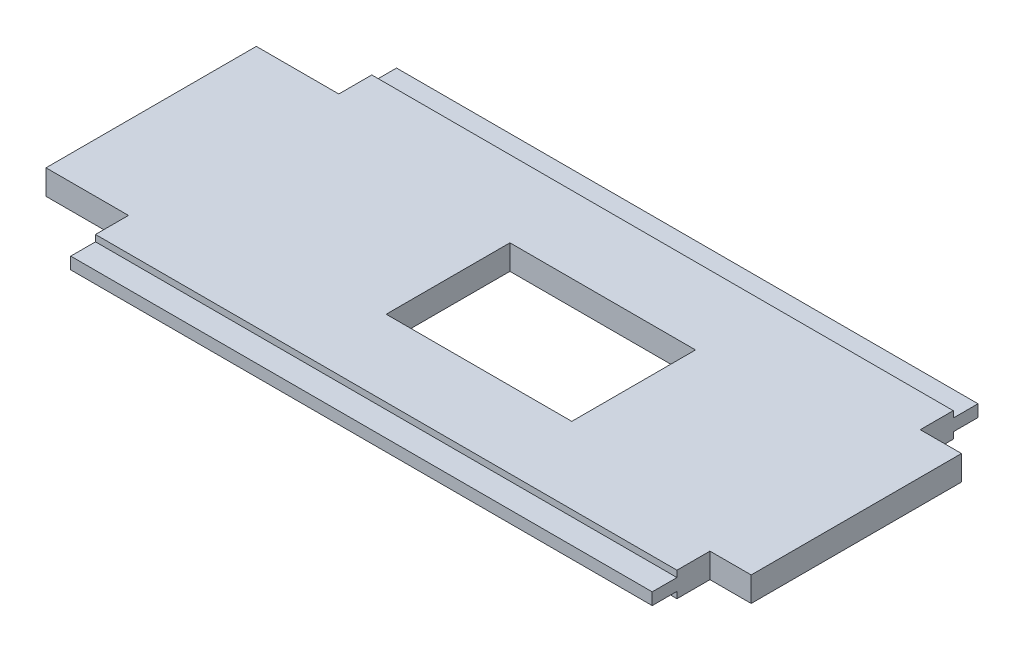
ISO-10303-21;
HEADER;
FILE_DESCRIPTION(('STEP AP214'),'2;1');
FILE_NAME('part.step','',(''),(''),'','','');
FILE_SCHEMA(('AUTOMOTIVE_DESIGN { 1 0 10303 214 1 1 1 1 }'));
ENDSEC;
DATA;
#1=APPLICATION_CONTEXT('core data for automotive mechanical design processes');
#2=APPLICATION_PROTOCOL_DEFINITION('international standard','automotive_design',2000,#1);
#3=PRODUCT_CONTEXT('',#1,'mechanical');
#4=PRODUCT('Part','Part','',(#3));
#5=PRODUCT_RELATED_PRODUCT_CATEGORY('part','',(#4));
#6=PRODUCT_DEFINITION_FORMATION('','',#4);
#7=PRODUCT_DEFINITION_CONTEXT('part definition',#1,'design');
#8=PRODUCT_DEFINITION('design','',#6,#7);
#9=PRODUCT_DEFINITION_SHAPE('','',#8);
#10=(LENGTH_UNIT() NAMED_UNIT(*) SI_UNIT(.MILLI.,.METRE.));
#11=(NAMED_UNIT(*) PLANE_ANGLE_UNIT() SI_UNIT($,.RADIAN.));
#12=(NAMED_UNIT(*) SI_UNIT($,.STERADIAN.) SOLID_ANGLE_UNIT());
#13=UNCERTAINTY_MEASURE_WITH_UNIT(LENGTH_MEASURE(1.E-05),#10,'distance_accuracy_value','');
#14=(GEOMETRIC_REPRESENTATION_CONTEXT(3) GLOBAL_UNCERTAINTY_ASSIGNED_CONTEXT((#13)) GLOBAL_UNIT_ASSIGNED_CONTEXT((#10,
#11,#12)) REPRESENTATION_CONTEXT('',''));
#15=CARTESIAN_POINT('',(0.,0.,0.));
#16=DIRECTION('',(0.,0.,1.));
#17=DIRECTION('',(1.,0.,0.));
#18=AXIS2_PLACEMENT_3D('',#15,#16,#17);
#19=CARTESIAN_POINT('',(141.,3.,0.));
#20=DIRECTION('',(-1.,0.,0.));
#21=DIRECTION('',(0.,0.,1.));
#22=AXIS2_PLACEMENT_3D('',#19,#20,#21);
#23=PLANE('',#22);
#24=DIRECTION('',(0.,-1.,0.));
#25=VECTOR('',#24,1.);
#26=CARTESIAN_POINT('',(141.,3.,-8.));
#27=LINE('',#26,#25);
#28=CARTESIAN_POINT('',(141.,3.,-8.));
#29=VERTEX_POINT('',#28);
#30=CARTESIAN_POINT('',(141.,-3.,-8.));
#31=VERTEX_POINT('',#30);
#32=EDGE_CURVE('E61',#29,#31,#27,.T.);
#33=ORIENTED_EDGE('',*,*,#32,.F.);
#34=DIRECTION('',(0.,0.,-1.));
#35=VECTOR('',#34,1.);
#36=CARTESIAN_POINT('',(141.,3.,0.));
#37=LINE('',#36,#35);
#38=CARTESIAN_POINT('',(141.,3.,0.));
#39=VERTEX_POINT('',#38);
#40=EDGE_CURVE('E402',#39,#29,#37,.T.);
#41=ORIENTED_EDGE('',*,*,#40,.F.);
#42=DIRECTION('',(0.,-1.,0.));
#43=VECTOR('',#42,1.);
#44=CARTESIAN_POINT('',(141.,3.,0.));
#45=LINE('',#44,#43);
#46=CARTESIAN_POINT('',(141.,1.45,0.));
#47=VERTEX_POINT('',#46);
#48=EDGE_CURVE('E432',#39,#47,#45,.T.);
#49=ORIENTED_EDGE('',*,*,#48,.T.);
#50=DIRECTION('',(0.,0.,-1.));
#51=VECTOR('',#50,1.);
#52=CARTESIAN_POINT('',(141.,1.45,0.));
#53=LINE('',#52,#51);
#54=CARTESIAN_POINT('',(141.,1.45,6.));
#55=VERTEX_POINT('',#54);
#56=EDGE_CURVE('E286',#55,#47,#53,.T.);
#57=ORIENTED_EDGE('',*,*,#56,.F.);
#58=DIRECTION('',(0.,-1.,0.));
#59=VECTOR('',#58,1.);
#60=CARTESIAN_POINT('',(141.,1.45,6.));
#61=LINE('',#60,#59);
#62=CARTESIAN_POINT('',(141.,-1.45,6.));
#63=VERTEX_POINT('',#62);
#64=EDGE_CURVE('E294',#55,#63,#61,.T.);
#65=ORIENTED_EDGE('',*,*,#64,.T.);
#66=DIRECTION('',(0.,0.,-1.));
#67=VECTOR('',#66,1.);
#68=CARTESIAN_POINT('',(141.,-1.45,0.));
#69=LINE('',#68,#67);
#70=CARTESIAN_POINT('',(141.,-1.45,0.));
#71=VERTEX_POINT('',#70);
#72=EDGE_CURVE('E303',#63,#71,#69,.T.);
#73=ORIENTED_EDGE('',*,*,#72,.T.);
#74=CARTESIAN_POINT('',(141.,-3.,0.));
#75=VERTEX_POINT('',#74);
#76=EDGE_CURVE('E431',#71,#75,#45,.T.);
#77=ORIENTED_EDGE('',*,*,#76,.T.);
#78=DIRECTION('',(0.,0.,-1.));
#79=VECTOR('',#78,1.);
#80=CARTESIAN_POINT('',(141.,-3.,0.));
#81=LINE('',#80,#79);
#82=EDGE_CURVE('E417',#75,#31,#81,.T.);
#83=ORIENTED_EDGE('',*,*,#82,.T.);
#84=EDGE_LOOP('',(#33,#41,#49,#57,#65,#73,#77,#83));
#85=FACE_BOUND('',#84,.T.);
#86=ADVANCED_FACE('F45',(#85),#23,.F.);
#87=DIRECTION('',(0.,1.,0.));
#88=VECTOR('',#87,1.);
#89=CARTESIAN_POINT('',(141.,3.,-59.));
#90=LINE('',#89,#88);
#91=CARTESIAN_POINT('',(141.,-3.,-59.));
#92=VERTEX_POINT('',#91);
#93=CARTESIAN_POINT('',(141.,3.,-59.));
#94=VERTEX_POINT('',#93);
#95=EDGE_CURVE('E69',#92,#94,#90,.T.);
#96=ORIENTED_EDGE('',*,*,#95,.F.);
#97=CARTESIAN_POINT('',(141.,-3.,-67.));
#98=VERTEX_POINT('',#97);
#99=EDGE_CURVE('E233',#92,#98,#81,.T.);
#100=ORIENTED_EDGE('',*,*,#99,.T.);
#101=DIRECTION('',(0.,-1.,0.));
#102=VECTOR('',#101,1.);
#103=CARTESIAN_POINT('',(141.,3.,-67.));
#104=LINE('',#103,#102);
#105=CARTESIAN_POINT('',(141.,-1.45,-67.));
#106=VERTEX_POINT('',#105);
#107=EDGE_CURVE('E428',#106,#98,#104,.T.);
#108=ORIENTED_EDGE('',*,*,#107,.F.);
#109=DIRECTION('',(0.,0.,-1.));
#110=VECTOR('',#109,1.);
#111=CARTESIAN_POINT('',(141.,-1.45,-67.));
#112=LINE('',#111,#110);
#113=CARTESIAN_POINT('',(141.,-1.45,-73.));
#114=VERTEX_POINT('',#113);
#115=EDGE_CURVE('E333',#106,#114,#112,.T.);
#116=ORIENTED_EDGE('',*,*,#115,.T.);
#117=DIRECTION('',(0.,-1.,0.));
#118=VECTOR('',#117,1.);
#119=CARTESIAN_POINT('',(141.,1.45,-73.));
#120=LINE('',#119,#118);
#121=CARTESIAN_POINT('',(141.,1.45,-73.));
#122=VERTEX_POINT('',#121);
#123=EDGE_CURVE('E269',#122,#114,#120,.T.);
#124=ORIENTED_EDGE('',*,*,#123,.F.);
#125=DIRECTION('',(0.,0.,-1.));
#126=VECTOR('',#125,1.);
#127=CARTESIAN_POINT('',(141.,1.45,-67.));
#128=LINE('',#127,#126);
#129=CARTESIAN_POINT('',(141.,1.45,-67.));
#130=VERTEX_POINT('',#129);
#131=EDGE_CURVE('E344',#130,#122,#128,.T.);
#132=ORIENTED_EDGE('',*,*,#131,.F.);
#133=CARTESIAN_POINT('',(141.,3.,-67.));
#134=VERTEX_POINT('',#133);
#135=EDGE_CURVE('E429',#134,#130,#104,.T.);
#136=ORIENTED_EDGE('',*,*,#135,.F.);
#137=EDGE_CURVE('E401',#94,#134,#37,.T.);
#138=ORIENTED_EDGE('',*,*,#137,.F.);
#139=EDGE_LOOP('',(#96,#100,#108,#116,#124,#132,#136,#138));
#140=FACE_BOUND('',#139,.T.);
#141=ADVANCED_FACE('F477',(#140),#23,.F.);
#142=CARTESIAN_POINT('',(0.,3.,0.));
#143=DIRECTION('',(1.,0.,0.));
#144=DIRECTION('',(0.,0.,-1.));
#145=AXIS2_PLACEMENT_3D('',#142,#143,#144);
#146=PLANE('',#145);
#147=DIRECTION('',(0.,0.,1.));
#148=VECTOR('',#147,1.);
#149=CARTESIAN_POINT('',(0.,-3.,0.));
#150=LINE('',#149,#148);
#151=CARTESIAN_POINT('',(0.,-3.,-67.));
#152=VERTEX_POINT('',#151);
#153=CARTESIAN_POINT('',(0.,-3.,-59.));
#154=VERTEX_POINT('',#153);
#155=EDGE_CURVE('E409',#152,#154,#150,.T.);
#156=ORIENTED_EDGE('',*,*,#155,.T.);
#157=DIRECTION('',(0.,1.,0.));
#158=VECTOR('',#157,1.);
#159=CARTESIAN_POINT('',(0.,3.,-59.));
#160=LINE('',#159,#158);
#161=CARTESIAN_POINT('',(0.,3.,-59.));
#162=VERTEX_POINT('',#161);
#163=EDGE_CURVE('E235',#154,#162,#160,.T.);
#164=ORIENTED_EDGE('',*,*,#163,.T.);
#165=DIRECTION('',(0.,0.,1.));
#166=VECTOR('',#165,1.);
#167=CARTESIAN_POINT('',(0.,3.,0.));
#168=LINE('',#167,#166);
#169=CARTESIAN_POINT('',(0.,3.,-67.));
#170=VERTEX_POINT('',#169);
#171=EDGE_CURVE('E393',#170,#162,#168,.T.);
#172=ORIENTED_EDGE('',*,*,#171,.F.);
#173=DIRECTION('',(0.,-1.,0.));
#174=VECTOR('',#173,1.);
#175=CARTESIAN_POINT('',(0.,3.,-67.));
#176=LINE('',#175,#174);
#177=CARTESIAN_POINT('',(0.,1.45,-67.));
#178=VERTEX_POINT('',#177);
#179=EDGE_CURVE('E424',#170,#178,#176,.T.);
#180=ORIENTED_EDGE('',*,*,#179,.T.);
#181=DIRECTION('',(0.,0.,1.));
#182=VECTOR('',#181,1.);
#183=CARTESIAN_POINT('',(0.,1.45,-67.));
#184=LINE('',#183,#182);
#185=CARTESIAN_POINT('',(0.,1.45,-73.));
#186=VERTEX_POINT('',#185);
#187=EDGE_CURVE('E324',#186,#178,#184,.T.);
#188=ORIENTED_EDGE('',*,*,#187,.F.);
#189=DIRECTION('',(0.,-1.,0.));
#190=VECTOR('',#189,1.);
#191=CARTESIAN_POINT('',(0.,1.45,-73.));
#192=LINE('',#191,#190);
#193=CARTESIAN_POINT('',(0.,-1.45,-73.));
#194=VERTEX_POINT('',#193);
#195=EDGE_CURVE('E320',#186,#194,#192,.T.);
#196=ORIENTED_EDGE('',*,*,#195,.T.);
#197=DIRECTION('',(0.,0.,1.));
#198=VECTOR('',#197,1.);
#199=CARTESIAN_POINT('',(0.,-1.45,-67.));
#200=LINE('',#199,#198);
#201=CARTESIAN_POINT('',(0.,-1.45,-67.));
#202=VERTEX_POINT('',#201);
#203=EDGE_CURVE('E325',#194,#202,#200,.T.);
#204=ORIENTED_EDGE('',*,*,#203,.T.);
#205=EDGE_CURVE('E408',#202,#152,#176,.T.);
#206=ORIENTED_EDGE('',*,*,#205,.T.);
#207=EDGE_LOOP('',(#156,#164,#172,#180,#188,#196,#204,#206));
#208=FACE_BOUND('',#207,.T.);
#209=ADVANCED_FACE('F483',(#208),#146,.F.);
#210=CARTESIAN_POINT('',(0.,3.,0.));
#211=DIRECTION('',(0.,0.,-1.));
#212=DIRECTION('',(-1.,0.,0.));
#213=AXIS2_PLACEMENT_3D('',#210,#211,#212);
#214=PLANE('',#213);
#215=DIRECTION('',(-1.,0.,0.));
#216=VECTOR('',#215,1.);
#217=CARTESIAN_POINT('',(0.,1.45,0.));
#218=LINE('',#217,#216);
#219=CARTESIAN_POINT('',(0.,1.45,0.));
#220=VERTEX_POINT('',#219);
#221=EDGE_CURVE('E290',#47,#220,#218,.T.);
#222=ORIENTED_EDGE('',*,*,#221,.F.);
#223=ORIENTED_EDGE('',*,*,#48,.F.);
#224=DIRECTION('',(1.,0.,0.));
#225=VECTOR('',#224,1.);
#226=CARTESIAN_POINT('',(0.,3.,0.));
#227=LINE('',#226,#225);
#228=CARTESIAN_POINT('',(0.,3.,0.));
#229=VERTEX_POINT('',#228);
#230=EDGE_CURVE('E397',#229,#39,#227,.T.);
#231=ORIENTED_EDGE('',*,*,#230,.F.);
#232=DIRECTION('',(0.,-1.,0.));
#233=VECTOR('',#232,1.);
#234=CARTESIAN_POINT('',(0.,3.,0.));
#235=LINE('',#234,#233);
#236=EDGE_CURVE('E11',#229,#220,#235,.T.);
#237=ORIENTED_EDGE('',*,*,#236,.T.);
#238=EDGE_LOOP('',(#222,#223,#231,#237));
#239=FACE_BOUND('',#238,.T.);
#240=ADVANCED_FACE('F488',(#239),#214,.F.);
#241=CARTESIAN_POINT('',(0.,3.,-67.));
#242=DIRECTION('',(0.,0.,1.));
#243=DIRECTION('',(1.,0.,0.));
#244=AXIS2_PLACEMENT_3D('',#241,#242,#243);
#245=PLANE('',#244);
#246=DIRECTION('',(1.,0.,0.));
#247=VECTOR('',#246,1.);
#248=CARTESIAN_POINT('',(0.,1.45,-67.));
#249=LINE('',#248,#247);
#250=EDGE_CURVE('E330',#178,#130,#249,.T.);
#251=ORIENTED_EDGE('',*,*,#250,.F.);
#252=ORIENTED_EDGE('',*,*,#179,.F.);
#253=DIRECTION('',(-1.,0.,0.));
#254=VECTOR('',#253,1.);
#255=CARTESIAN_POINT('',(0.,3.,-67.));
#256=LINE('',#255,#254);
#257=EDGE_CURVE('E405',#134,#170,#256,.T.);
#258=ORIENTED_EDGE('',*,*,#257,.F.);
#259=ORIENTED_EDGE('',*,*,#135,.T.);
#260=EDGE_LOOP('',(#251,#252,#258,#259));
#261=FACE_BOUND('',#260,.T.);
#262=ADVANCED_FACE('F495',(#261),#245,.F.);
#263=CARTESIAN_POINT('',(0.,3.,0.));
#264=DIRECTION('',(0.,-1.,0.));
#265=DIRECTION('',(0.,0.,-1.));
#266=AXIS2_PLACEMENT_3D('',#263,#264,#265);
#267=PLANE('',#266);
#268=ORIENTED_EDGE('',*,*,#171,.T.);
#269=DIRECTION('',(1.,0.,0.));
#270=VECTOR('',#269,1.);
#271=CARTESIAN_POINT('',(-20.,3.,-59.));
#272=LINE('',#271,#270);
#273=CARTESIAN_POINT('',(-20.,3.,-59.));
#274=VERTEX_POINT('',#273);
#275=EDGE_CURVE('E261',#274,#162,#272,.T.);
#276=ORIENTED_EDGE('',*,*,#275,.F.);
#277=DIRECTION('',(0.,0.,1.));
#278=VECTOR('',#277,1.);
#279=CARTESIAN_POINT('',(-20.,3.,-59.));
#280=LINE('',#279,#278);
#281=CARTESIAN_POINT('',(-20.,3.,-8.));
#282=VERTEX_POINT('',#281);
#283=EDGE_CURVE('E250',#274,#282,#280,.T.);
#284=ORIENTED_EDGE('',*,*,#283,.T.);
#285=DIRECTION('',(1.,0.,0.));
#286=VECTOR('',#285,1.);
#287=CARTESIAN_POINT('',(-20.,3.,-8.));
#288=LINE('',#287,#286);
#289=CARTESIAN_POINT('',(0.,3.,-8.));
#290=VERTEX_POINT('',#289);
#291=EDGE_CURVE('E273',#282,#290,#288,.T.);
#292=ORIENTED_EDGE('',*,*,#291,.T.);
#293=EDGE_CURVE('E398',#290,#229,#168,.T.);
#294=ORIENTED_EDGE('',*,*,#293,.T.);
#295=ORIENTED_EDGE('',*,*,#230,.T.);
#296=ORIENTED_EDGE('',*,*,#40,.T.);
#297=DIRECTION('',(-1.,0.,0.));
#298=VECTOR('',#297,1.);
#299=CARTESIAN_POINT('',(151.,3.,-8.));
#300=LINE('',#299,#298);
#301=CARTESIAN_POINT('',(151.,3.,-8.));
#302=VERTEX_POINT('',#301);
#303=EDGE_CURVE('E242',#302,#29,#300,.T.);
#304=ORIENTED_EDGE('',*,*,#303,.F.);
#305=DIRECTION('',(0.,0.,1.));
#306=VECTOR('',#305,1.);
#307=CARTESIAN_POINT('',(151.,3.,0.));
#308=LINE('',#307,#306);
#309=CARTESIAN_POINT('',(151.,3.,-59.));
#310=VERTEX_POINT('',#309);
#311=EDGE_CURVE('E217',#310,#302,#308,.T.);
#312=ORIENTED_EDGE('',*,*,#311,.F.);
#313=DIRECTION('',(-1.,0.,0.));
#314=VECTOR('',#313,1.);
#315=CARTESIAN_POINT('',(151.,3.,-59.));
#316=LINE('',#315,#314);
#317=EDGE_CURVE('E213',#310,#94,#316,.T.);
#318=ORIENTED_EDGE('',*,*,#317,.T.);
#319=ORIENTED_EDGE('',*,*,#137,.T.);
#320=ORIENTED_EDGE('',*,*,#257,.T.);
#321=EDGE_LOOP('',(#268,#276,#284,#292,#294,#295,#296,#304,#312,#318,#319,#320));
#322=FACE_BOUND('',#321,.T.);
#323=DIRECTION('',(0.,0.,1.));
#324=VECTOR('',#323,1.);
#325=CARTESIAN_POINT('',(52.,3.,-48.5));
#326=LINE('',#325,#324);
#327=CARTESIAN_POINT('',(52.,3.,-48.5));
#328=VERTEX_POINT('',#327);
#329=CARTESIAN_POINT('',(52.,3.,-18.5));
#330=VERTEX_POINT('',#329);
#331=EDGE_CURVE('E350',#328,#330,#326,.T.);
#332=ORIENTED_EDGE('',*,*,#331,.F.);
#333=DIRECTION('',(-1.,0.,0.));
#334=VECTOR('',#333,1.);
#335=CARTESIAN_POINT('',(52.,3.,-48.5));
#336=LINE('',#335,#334);
#337=CARTESIAN_POINT('',(97.,3.,-48.5));
#338=VERTEX_POINT('',#337);
#339=EDGE_CURVE('E361',#338,#328,#336,.T.);
#340=ORIENTED_EDGE('',*,*,#339,.F.);
#341=DIRECTION('',(0.,0.,-1.));
#342=VECTOR('',#341,1.);
#343=CARTESIAN_POINT('',(97.,3.,-48.5));
#344=LINE('',#343,#342);
#345=CARTESIAN_POINT('',(97.,3.,-18.5));
#346=VERTEX_POINT('',#345);
#347=EDGE_CURVE('E357',#346,#338,#344,.T.);
#348=ORIENTED_EDGE('',*,*,#347,.F.);
#349=DIRECTION('',(1.,0.,0.));
#350=VECTOR('',#349,1.);
#351=CARTESIAN_POINT('',(52.,3.,-18.5));
#352=LINE('',#351,#350);
#353=EDGE_CURVE('E353',#330,#346,#352,.T.);
#354=ORIENTED_EDGE('',*,*,#353,.F.);
#355=EDGE_LOOP('',(#332,#340,#348,#354));
#356=FACE_BOUND('',#355,.T.);
#357=ADVANCED_FACE('F464',(#322,#356),#267,.F.);
#358=CARTESIAN_POINT('',(0.,-3.,0.));
#359=DIRECTION('',(0.,-1.,0.));
#360=DIRECTION('',(0.,0.,-1.));
#361=AXIS2_PLACEMENT_3D('',#358,#359,#360);
#362=PLANE('',#361);
#363=ORIENTED_EDGE('',*,*,#155,.F.);
#364=DIRECTION('',(-1.,0.,0.));
#365=VECTOR('',#364,1.);
#366=CARTESIAN_POINT('',(0.,-3.,-67.));
#367=LINE('',#366,#365);
#368=EDGE_CURVE('E420',#98,#152,#367,.T.);
#369=ORIENTED_EDGE('',*,*,#368,.F.);
#370=ORIENTED_EDGE('',*,*,#99,.F.);
#371=DIRECTION('',(-1.,0.,0.));
#372=VECTOR('',#371,1.);
#373=CARTESIAN_POINT('',(151.,-3.,-59.));
#374=LINE('',#373,#372);
#375=CARTESIAN_POINT('',(151.,-3.,-59.));
#376=VERTEX_POINT('',#375);
#377=EDGE_CURVE('E211',#376,#92,#374,.T.);
#378=ORIENTED_EDGE('',*,*,#377,.F.);
#379=DIRECTION('',(0.,0.,-1.));
#380=VECTOR('',#379,1.);
#381=CARTESIAN_POINT('',(151.,-3.,0.));
#382=LINE('',#381,#380);
#383=CARTESIAN_POINT('',(151.,-3.,-8.));
#384=VERTEX_POINT('',#383);
#385=EDGE_CURVE('E218',#384,#376,#382,.T.);
#386=ORIENTED_EDGE('',*,*,#385,.F.);
#387=DIRECTION('',(-1.,0.,0.));
#388=VECTOR('',#387,1.);
#389=CARTESIAN_POINT('',(151.,-3.,-8.));
#390=LINE('',#389,#388);
#391=EDGE_CURVE('E448',#384,#31,#390,.T.);
#392=ORIENTED_EDGE('',*,*,#391,.T.);
#393=ORIENTED_EDGE('',*,*,#82,.F.);
#394=DIRECTION('',(1.,0.,0.));
#395=VECTOR('',#394,1.);
#396=CARTESIAN_POINT('',(0.,-3.,0.));
#397=LINE('',#396,#395);
#398=CARTESIAN_POINT('',(0.,-3.,0.));
#399=VERTEX_POINT('',#398);
#400=EDGE_CURVE('E413',#399,#75,#397,.T.);
#401=ORIENTED_EDGE('',*,*,#400,.F.);
#402=CARTESIAN_POINT('',(0.,-3.,-8.));
#403=VERTEX_POINT('',#402);
#404=EDGE_CURVE('E392',#403,#399,#150,.T.);
#405=ORIENTED_EDGE('',*,*,#404,.F.);
#406=DIRECTION('',(1.,0.,0.));
#407=VECTOR('',#406,1.);
#408=CARTESIAN_POINT('',(-20.,-3.,-8.));
#409=LINE('',#408,#407);
#410=CARTESIAN_POINT('',(-20.,-3.,-8.));
#411=VERTEX_POINT('',#410);
#412=EDGE_CURVE('E270',#411,#403,#409,.T.);
#413=ORIENTED_EDGE('',*,*,#412,.F.);
#414=DIRECTION('',(0.,0.,-1.));
#415=VECTOR('',#414,1.);
#416=CARTESIAN_POINT('',(-20.,-3.,-59.));
#417=LINE('',#416,#415);
#418=CARTESIAN_POINT('',(-20.,-3.,-59.));
#419=VERTEX_POINT('',#418);
#420=EDGE_CURVE('E258',#411,#419,#417,.T.);
#421=ORIENTED_EDGE('',*,*,#420,.T.);
#422=DIRECTION('',(1.,0.,0.));
#423=VECTOR('',#422,1.);
#424=CARTESIAN_POINT('',(-20.,-3.,-59.));
#425=LINE('',#424,#423);
#426=EDGE_CURVE('E266',#419,#154,#425,.T.);
#427=ORIENTED_EDGE('',*,*,#426,.T.);
#428=EDGE_LOOP('',(#363,#369,#370,#378,#386,#392,#393,#401,#405,#413,#421,#427));
#429=FACE_BOUND('',#428,.T.);
#430=DIRECTION('',(-1.,0.,0.));
#431=VECTOR('',#430,1.);
#432=CARTESIAN_POINT('',(52.,-3.,-48.5));
#433=LINE('',#432,#431);
#434=CARTESIAN_POINT('',(97.,-3.,-48.5));
#435=VERTEX_POINT('',#434);
#436=CARTESIAN_POINT('',(52.,-3.,-48.5));
#437=VERTEX_POINT('',#436);
#438=EDGE_CURVE('E354',#435,#437,#433,.T.);
#439=ORIENTED_EDGE('',*,*,#438,.T.);
#440=DIRECTION('',(0.,0.,1.));
#441=VECTOR('',#440,1.);
#442=CARTESIAN_POINT('',(52.,-3.,-48.5));
#443=LINE('',#442,#441);
#444=CARTESIAN_POINT('',(52.,-3.,-18.5));
#445=VERTEX_POINT('',#444);
#446=EDGE_CURVE('E316',#437,#445,#443,.T.);
#447=ORIENTED_EDGE('',*,*,#446,.T.);
#448=DIRECTION('',(1.,0.,0.));
#449=VECTOR('',#448,1.);
#450=CARTESIAN_POINT('',(52.,-3.,-18.5));
#451=LINE('',#450,#449);
#452=CARTESIAN_POINT('',(97.,-3.,-18.5));
#453=VERTEX_POINT('',#452);
#454=EDGE_CURVE('E368',#445,#453,#451,.T.);
#455=ORIENTED_EDGE('',*,*,#454,.T.);
#456=DIRECTION('',(0.,0.,-1.));
#457=VECTOR('',#456,1.);
#458=CARTESIAN_POINT('',(97.,-3.,-48.5));
#459=LINE('',#458,#457);
#460=EDGE_CURVE('E372',#453,#435,#459,.T.);
#461=ORIENTED_EDGE('',*,*,#460,.T.);
#462=EDGE_LOOP('',(#439,#447,#455,#461));
#463=FACE_BOUND('',#462,.T.);
#464=ADVANCED_FACE('F230',(#429,#463),#362,.T.);
#465=ORIENTED_EDGE('',*,*,#293,.F.);
#466=DIRECTION('',(0.,-1.,0.));
#467=VECTOR('',#466,1.);
#468=CARTESIAN_POINT('',(0.,3.,-8.));
#469=LINE('',#468,#467);
#470=EDGE_CURVE('E240',#290,#403,#469,.T.);
#471=ORIENTED_EDGE('',*,*,#470,.T.);
#472=ORIENTED_EDGE('',*,*,#404,.T.);
#473=CARTESIAN_POINT('',(0.,-1.45,0.));
#474=VERTEX_POINT('',#473);
#475=EDGE_CURVE('E54',#474,#399,#235,.T.);
#476=ORIENTED_EDGE('',*,*,#475,.F.);
#477=DIRECTION('',(0.,0.,1.));
#478=VECTOR('',#477,1.);
#479=CARTESIAN_POINT('',(0.,-1.45,0.));
#480=LINE('',#479,#478);
#481=CARTESIAN_POINT('',(0.,-1.45,6.));
#482=VERTEX_POINT('',#481);
#483=EDGE_CURVE('E295',#474,#482,#480,.T.);
#484=ORIENTED_EDGE('',*,*,#483,.T.);
#485=DIRECTION('',(0.,-1.,0.));
#486=VECTOR('',#485,1.);
#487=CARTESIAN_POINT('',(0.,1.45,6.));
#488=LINE('',#487,#486);
#489=CARTESIAN_POINT('',(0.,1.45,6.));
#490=VERTEX_POINT('',#489);
#491=EDGE_CURVE('E312',#490,#482,#488,.T.);
#492=ORIENTED_EDGE('',*,*,#491,.F.);
#493=DIRECTION('',(0.,0.,1.));
#494=VECTOR('',#493,1.);
#495=CARTESIAN_POINT('',(0.,1.45,0.));
#496=LINE('',#495,#494);
#497=EDGE_CURVE('E278',#220,#490,#496,.T.);
#498=ORIENTED_EDGE('',*,*,#497,.F.);
#499=ORIENTED_EDGE('',*,*,#236,.F.);
#500=EDGE_LOOP('',(#465,#471,#472,#476,#484,#492,#498,#499));
#501=FACE_BOUND('',#500,.T.);
#502=ADVANCED_FACE('F47',(#501),#146,.F.);
#503=ORIENTED_EDGE('',*,*,#76,.F.);
#504=DIRECTION('',(-1.,0.,0.));
#505=VECTOR('',#504,1.);
#506=CARTESIAN_POINT('',(0.,-1.45,0.));
#507=LINE('',#506,#505);
#508=EDGE_CURVE('E283',#71,#474,#507,.T.);
#509=ORIENTED_EDGE('',*,*,#508,.T.);
#510=ORIENTED_EDGE('',*,*,#475,.T.);
#511=ORIENTED_EDGE('',*,*,#400,.T.);
#512=EDGE_LOOP('',(#503,#509,#510,#511));
#513=FACE_BOUND('',#512,.T.);
#514=ADVANCED_FACE('F445',(#513),#214,.F.);
#515=ORIENTED_EDGE('',*,*,#205,.F.);
#516=DIRECTION('',(1.,0.,0.));
#517=VECTOR('',#516,1.);
#518=CARTESIAN_POINT('',(0.,-1.45,-67.));
#519=LINE('',#518,#517);
#520=EDGE_CURVE('E300',#202,#106,#519,.T.);
#521=ORIENTED_EDGE('',*,*,#520,.T.);
#522=ORIENTED_EDGE('',*,*,#107,.T.);
#523=ORIENTED_EDGE('',*,*,#368,.T.);
#524=EDGE_LOOP('',(#515,#521,#522,#523));
#525=FACE_BOUND('',#524,.T.);
#526=ADVANCED_FACE('F485',(#525),#245,.F.);
#527=CARTESIAN_POINT('',(52.,3.,-48.5));
#528=DIRECTION('',(1.,0.,0.));
#529=DIRECTION('',(0.,0.,-1.));
#530=AXIS2_PLACEMENT_3D('',#527,#528,#529);
#531=PLANE('',#530);
#532=ORIENTED_EDGE('',*,*,#446,.F.);
#533=DIRECTION('',(0.,-1.,0.));
#534=VECTOR('',#533,1.);
#535=CARTESIAN_POINT('',(52.,3.,-48.5));
#536=LINE('',#535,#534);
#537=EDGE_CURVE('E364',#328,#437,#536,.T.);
#538=ORIENTED_EDGE('',*,*,#537,.F.);
#539=ORIENTED_EDGE('',*,*,#331,.T.);
#540=DIRECTION('',(0.,-1.,0.));
#541=VECTOR('',#540,1.);
#542=CARTESIAN_POINT('',(52.,3.,-18.5));
#543=LINE('',#542,#541);
#544=EDGE_CURVE('E388',#330,#445,#543,.T.);
#545=ORIENTED_EDGE('',*,*,#544,.T.);
#546=EDGE_LOOP('',(#532,#538,#539,#545));
#547=FACE_BOUND('',#546,.T.);
#548=ADVANCED_FACE('F493',(#547),#531,.T.);
#549=CARTESIAN_POINT('',(52.,3.,-18.5));
#550=DIRECTION('',(0.,0.,-1.));
#551=DIRECTION('',(-1.,0.,0.));
#552=AXIS2_PLACEMENT_3D('',#549,#550,#551);
#553=PLANE('',#552);
#554=ORIENTED_EDGE('',*,*,#454,.F.);
#555=ORIENTED_EDGE('',*,*,#544,.F.);
#556=ORIENTED_EDGE('',*,*,#353,.T.);
#557=DIRECTION('',(0.,-1.,0.));
#558=VECTOR('',#557,1.);
#559=CARTESIAN_POINT('',(97.,3.,-18.5));
#560=LINE('',#559,#558);
#561=EDGE_CURVE('E385',#346,#453,#560,.T.);
#562=ORIENTED_EDGE('',*,*,#561,.T.);
#563=EDGE_LOOP('',(#554,#555,#556,#562));
#564=FACE_BOUND('',#563,.T.);
#565=ADVANCED_FACE('F583',(#564),#553,.T.);
#566=CARTESIAN_POINT('',(97.,3.,-48.5));
#567=DIRECTION('',(-1.,0.,0.));
#568=DIRECTION('',(0.,0.,1.));
#569=AXIS2_PLACEMENT_3D('',#566,#567,#568);
#570=PLANE('',#569);
#571=ORIENTED_EDGE('',*,*,#460,.F.);
#572=ORIENTED_EDGE('',*,*,#561,.F.);
#573=ORIENTED_EDGE('',*,*,#347,.T.);
#574=DIRECTION('',(0.,-1.,0.));
#575=VECTOR('',#574,1.);
#576=CARTESIAN_POINT('',(97.,3.,-48.5));
#577=LINE('',#576,#575);
#578=EDGE_CURVE('E382',#338,#435,#577,.T.);
#579=ORIENTED_EDGE('',*,*,#578,.T.);
#580=EDGE_LOOP('',(#571,#572,#573,#579));
#581=FACE_BOUND('',#580,.T.);
#582=ADVANCED_FACE('F579',(#581),#570,.T.);
#583=CARTESIAN_POINT('',(52.,3.,-48.5));
#584=DIRECTION('',(0.,0.,1.));
#585=DIRECTION('',(1.,0.,0.));
#586=AXIS2_PLACEMENT_3D('',#583,#584,#585);
#587=PLANE('',#586);
#588=ORIENTED_EDGE('',*,*,#438,.F.);
#589=ORIENTED_EDGE('',*,*,#578,.F.);
#590=ORIENTED_EDGE('',*,*,#339,.T.);
#591=ORIENTED_EDGE('',*,*,#537,.T.);
#592=EDGE_LOOP('',(#588,#589,#590,#591));
#593=FACE_BOUND('',#592,.T.);
#594=ADVANCED_FACE('F573',(#593),#587,.T.);
#595=CARTESIAN_POINT('',(0.,1.45,-73.));
#596=DIRECTION('',(0.,0.,1.));
#597=DIRECTION('',(1.,0.,0.));
#598=AXIS2_PLACEMENT_3D('',#595,#596,#597);
#599=PLANE('',#598);
#600=DIRECTION('',(-1.,0.,0.));
#601=VECTOR('',#600,1.);
#602=CARTESIAN_POINT('',(0.,-1.45,-73.));
#603=LINE('',#602,#601);
#604=EDGE_CURVE('E329',#114,#194,#603,.T.);
#605=ORIENTED_EDGE('',*,*,#604,.T.);
#606=ORIENTED_EDGE('',*,*,#195,.F.);
#607=DIRECTION('',(-1.,0.,0.));
#608=VECTOR('',#607,1.);
#609=CARTESIAN_POINT('',(0.,1.45,-73.));
#610=LINE('',#609,#608);
#611=EDGE_CURVE('E341',#122,#186,#610,.T.);
#612=ORIENTED_EDGE('',*,*,#611,.F.);
#613=ORIENTED_EDGE('',*,*,#123,.T.);
#614=EDGE_LOOP('',(#605,#606,#612,#613));
#615=FACE_BOUND('',#614,.T.);
#616=ADVANCED_FACE('F542',(#615),#599,.F.);
#617=CARTESIAN_POINT('',(0.,1.45,0.));
#618=DIRECTION('',(0.,1.,0.));
#619=DIRECTION('',(0.,0.,1.));
#620=AXIS2_PLACEMENT_3D('',#617,#618,#619);
#621=PLANE('',#620);
#622=ORIENTED_EDGE('',*,*,#250,.T.);
#623=ORIENTED_EDGE('',*,*,#131,.T.);
#624=ORIENTED_EDGE('',*,*,#611,.T.);
#625=ORIENTED_EDGE('',*,*,#187,.T.);
#626=EDGE_LOOP('',(#622,#623,#624,#625));
#627=FACE_BOUND('',#626,.T.);
#628=ADVANCED_FACE('F544',(#627),#621,.T.);
#629=CARTESIAN_POINT('',(0.,-1.45,0.));
#630=DIRECTION('',(0.,1.,0.));
#631=DIRECTION('',(0.,0.,1.));
#632=AXIS2_PLACEMENT_3D('',#629,#630,#631);
#633=PLANE('',#632);
#634=ORIENTED_EDGE('',*,*,#520,.F.);
#635=ORIENTED_EDGE('',*,*,#203,.F.);
#636=ORIENTED_EDGE('',*,*,#604,.F.);
#637=ORIENTED_EDGE('',*,*,#115,.F.);
#638=EDGE_LOOP('',(#634,#635,#636,#637));
#639=FACE_BOUND('',#638,.T.);
#640=ADVANCED_FACE('F537',(#639),#633,.F.);
#641=CARTESIAN_POINT('',(0.,1.45,6.));
#642=DIRECTION('',(0.,0.,-1.));
#643=DIRECTION('',(-1.,0.,0.));
#644=AXIS2_PLACEMENT_3D('',#641,#642,#643);
#645=PLANE('',#644);
#646=DIRECTION('',(1.,0.,0.));
#647=VECTOR('',#646,1.);
#648=CARTESIAN_POINT('',(0.,-1.45,6.));
#649=LINE('',#648,#647);
#650=EDGE_CURVE('E299',#482,#63,#649,.T.);
#651=ORIENTED_EDGE('',*,*,#650,.T.);
#652=ORIENTED_EDGE('',*,*,#64,.F.);
#653=DIRECTION('',(1.,0.,0.));
#654=VECTOR('',#653,1.);
#655=CARTESIAN_POINT('',(0.,1.45,6.));
#656=LINE('',#655,#654);
#657=EDGE_CURVE('E282',#490,#55,#656,.T.);
#658=ORIENTED_EDGE('',*,*,#657,.F.);
#659=ORIENTED_EDGE('',*,*,#491,.T.);
#660=EDGE_LOOP('',(#651,#652,#658,#659));
#661=FACE_BOUND('',#660,.T.);
#662=ADVANCED_FACE('F515',(#661),#645,.F.);
#663=CARTESIAN_POINT('',(0.,1.45,0.));
#664=DIRECTION('',(0.,1.,0.));
#665=DIRECTION('',(0.,0.,1.));
#666=AXIS2_PLACEMENT_3D('',#663,#664,#665);
#667=PLANE('',#666);
#668=ORIENTED_EDGE('',*,*,#497,.T.);
#669=ORIENTED_EDGE('',*,*,#657,.T.);
#670=ORIENTED_EDGE('',*,*,#56,.T.);
#671=ORIENTED_EDGE('',*,*,#221,.T.);
#672=EDGE_LOOP('',(#668,#669,#670,#671));
#673=FACE_BOUND('',#672,.T.);
#674=ADVANCED_FACE('F510',(#673),#667,.T.);
#675=CARTESIAN_POINT('',(0.,-1.45,0.));
#676=DIRECTION('',(0.,1.,0.));
#677=DIRECTION('',(0.,0.,1.));
#678=AXIS2_PLACEMENT_3D('',#675,#676,#677);
#679=PLANE('',#678);
#680=ORIENTED_EDGE('',*,*,#483,.F.);
#681=ORIENTED_EDGE('',*,*,#508,.F.);
#682=ORIENTED_EDGE('',*,*,#72,.F.);
#683=ORIENTED_EDGE('',*,*,#650,.F.);
#684=EDGE_LOOP('',(#680,#681,#682,#683));
#685=FACE_BOUND('',#684,.T.);
#686=ADVANCED_FACE('F518',(#685),#679,.F.);
#687=CARTESIAN_POINT('',(-20.,3.,-59.));
#688=DIRECTION('',(0.,0.,-1.));
#689=DIRECTION('',(-1.,0.,0.));
#690=AXIS2_PLACEMENT_3D('',#687,#688,#689);
#691=PLANE('',#690);
#692=ORIENTED_EDGE('',*,*,#163,.F.);
#693=ORIENTED_EDGE('',*,*,#426,.F.);
#694=DIRECTION('',(0.,1.,0.));
#695=VECTOR('',#694,1.);
#696=CARTESIAN_POINT('',(-20.,3.,-59.));
#697=LINE('',#696,#695);
#698=EDGE_CURVE('E246',#419,#274,#697,.T.);
#699=ORIENTED_EDGE('',*,*,#698,.T.);
#700=ORIENTED_EDGE('',*,*,#275,.T.);
#701=EDGE_LOOP('',(#692,#693,#699,#700));
#702=FACE_BOUND('',#701,.T.);
#703=ADVANCED_FACE('F554',(#702),#691,.T.);
#704=CARTESIAN_POINT('',(-20.,3.,-8.));
#705=DIRECTION('',(0.,0.,1.));
#706=DIRECTION('',(1.,0.,0.));
#707=AXIS2_PLACEMENT_3D('',#704,#705,#706);
#708=PLANE('',#707);
#709=ORIENTED_EDGE('',*,*,#470,.F.);
#710=ORIENTED_EDGE('',*,*,#291,.F.);
#711=DIRECTION('',(0.,-1.,0.));
#712=VECTOR('',#711,1.);
#713=CARTESIAN_POINT('',(-20.,3.,-8.));
#714=LINE('',#713,#712);
#715=EDGE_CURVE('E254',#282,#411,#714,.T.);
#716=ORIENTED_EDGE('',*,*,#715,.T.);
#717=ORIENTED_EDGE('',*,*,#412,.T.);
#718=EDGE_LOOP('',(#709,#710,#716,#717));
#719=FACE_BOUND('',#718,.T.);
#720=ADVANCED_FACE('F556',(#719),#708,.T.);
#721=CARTESIAN_POINT('',(-20.,0.,0.));
#722=DIRECTION('',(-1.,0.,0.));
#723=DIRECTION('',(0.,0.,1.));
#724=AXIS2_PLACEMENT_3D('',#721,#722,#723);
#725=PLANE('',#724);
#726=ORIENTED_EDGE('',*,*,#698,.F.);
#727=ORIENTED_EDGE('',*,*,#420,.F.);
#728=ORIENTED_EDGE('',*,*,#715,.F.);
#729=ORIENTED_EDGE('',*,*,#283,.F.);
#730=EDGE_LOOP('',(#726,#727,#728,#729));
#731=FACE_BOUND('',#730,.T.);
#732=ADVANCED_FACE('F474',(#731),#725,.T.);
#733=CARTESIAN_POINT('',(151.,3.,-59.));
#734=DIRECTION('',(0.,0.,1.));
#735=DIRECTION('',(1.,0.,0.));
#736=AXIS2_PLACEMENT_3D('',#733,#734,#735);
#737=PLANE('',#736);
#738=ORIENTED_EDGE('',*,*,#95,.T.);
#739=ORIENTED_EDGE('',*,*,#317,.F.);
#740=DIRECTION('',(0.,1.,0.));
#741=VECTOR('',#740,1.);
#742=CARTESIAN_POINT('',(151.,3.,-59.));
#743=LINE('',#742,#741);
#744=EDGE_CURVE('E207',#376,#310,#743,.T.);
#745=ORIENTED_EDGE('',*,*,#744,.F.);
#746=ORIENTED_EDGE('',*,*,#377,.T.);
#747=EDGE_LOOP('',(#738,#739,#745,#746));
#748=FACE_BOUND('',#747,.T.);
#749=ADVANCED_FACE('F209',(#748),#737,.F.);
#750=CARTESIAN_POINT('',(151.,3.,-8.));
#751=DIRECTION('',(0.,0.,-1.));
#752=DIRECTION('',(-1.,0.,0.));
#753=AXIS2_PLACEMENT_3D('',#750,#751,#752);
#754=PLANE('',#753);
#755=ORIENTED_EDGE('',*,*,#32,.T.);
#756=ORIENTED_EDGE('',*,*,#391,.F.);
#757=DIRECTION('',(0.,-1.,0.));
#758=VECTOR('',#757,1.);
#759=CARTESIAN_POINT('',(151.,3.,-8.));
#760=LINE('',#759,#758);
#761=EDGE_CURVE('E223',#302,#384,#760,.T.);
#762=ORIENTED_EDGE('',*,*,#761,.F.);
#763=ORIENTED_EDGE('',*,*,#303,.T.);
#764=EDGE_LOOP('',(#755,#756,#762,#763));
#765=FACE_BOUND('',#764,.T.);
#766=ADVANCED_FACE('F466',(#765),#754,.F.);
#767=CARTESIAN_POINT('',(151.,0.,0.));
#768=DIRECTION('',(1.,0.,0.));
#769=DIRECTION('',(0.,0.,-1.));
#770=AXIS2_PLACEMENT_3D('',#767,#768,#769);
#771=PLANE('',#770);
#772=ORIENTED_EDGE('',*,*,#385,.T.);
#773=ORIENTED_EDGE('',*,*,#744,.T.);
#774=ORIENTED_EDGE('',*,*,#311,.T.);
#775=ORIENTED_EDGE('',*,*,#761,.T.);
#776=EDGE_LOOP('',(#772,#773,#774,#775));
#777=FACE_BOUND('',#776,.T.);
#778=ADVANCED_FACE('F221',(#777),#771,.T.);
#779=CLOSED_SHELL('',(#86,#141,#209,#240,#262,#357,#464,#502,#514,#526,#548,#565,#582,#594,#616,
#628,#640,#662,#674,#686,#703,#720,#732,#749,#766,#778));
#780=MANIFOLD_SOLID_BREP('B2',#779);
#781=ADVANCED_BREP_SHAPE_REPRESENTATION('',(#18,#780),#14);
#782=SHAPE_DEFINITION_REPRESENTATION(#9,#781);
ENDSEC;
END-ISO-10303-21;
